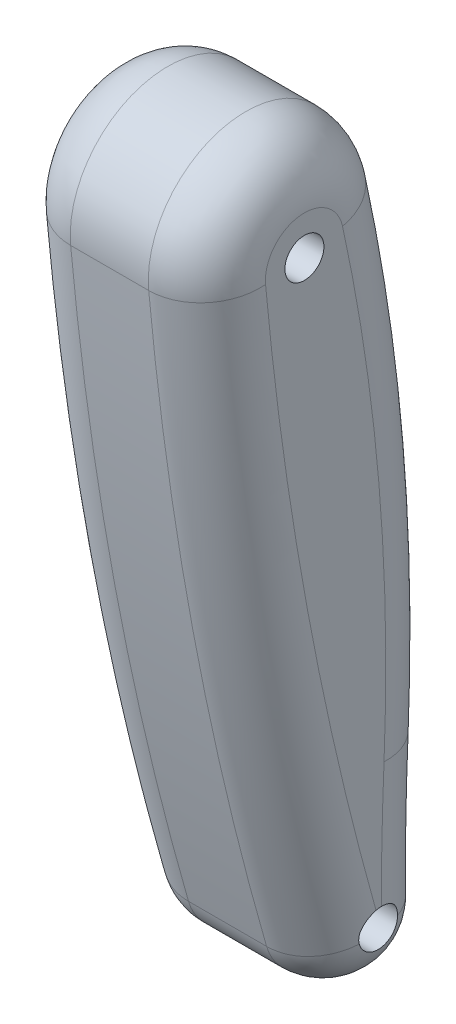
ISO-10303-21;
HEADER;
FILE_DESCRIPTION(('STEP AP214'),'2;1');
FILE_NAME('part.step','',(''),(''),'','','');
FILE_SCHEMA(('AUTOMOTIVE_DESIGN { 1 0 10303 214 1 1 1 1 }'));
ENDSEC;
DATA;
#1=APPLICATION_CONTEXT('core data for automotive mechanical design processes');
#2=APPLICATION_PROTOCOL_DEFINITION('international standard','automotive_design',2000,#1);
#3=PRODUCT_CONTEXT('',#1,'mechanical');
#4=PRODUCT('Part','Part','',(#3));
#5=PRODUCT_RELATED_PRODUCT_CATEGORY('part','',(#4));
#6=PRODUCT_DEFINITION_FORMATION('','',#4);
#7=PRODUCT_DEFINITION_CONTEXT('part definition',#1,'design');
#8=PRODUCT_DEFINITION('design','',#6,#7);
#9=PRODUCT_DEFINITION_SHAPE('','',#8);
#10=(LENGTH_UNIT() NAMED_UNIT(*) SI_UNIT(.MILLI.,.METRE.));
#11=(NAMED_UNIT(*) PLANE_ANGLE_UNIT() SI_UNIT($,.RADIAN.));
#12=(NAMED_UNIT(*) SI_UNIT($,.STERADIAN.) SOLID_ANGLE_UNIT());
#13=UNCERTAINTY_MEASURE_WITH_UNIT(LENGTH_MEASURE(1.E-05),#10,'distance_accuracy_value','');
#14=(GEOMETRIC_REPRESENTATION_CONTEXT(3) GLOBAL_UNCERTAINTY_ASSIGNED_CONTEXT((#13)) GLOBAL_UNIT_ASSIGNED_CONTEXT((#10,
#11,#12)) REPRESENTATION_CONTEXT('',''));
#15=CARTESIAN_POINT('',(0.,0.,0.));
#16=DIRECTION('',(0.,0.,1.));
#17=DIRECTION('',(1.,0.,0.));
#18=AXIS2_PLACEMENT_3D('',#15,#16,#17);
#19=CARTESIAN_POINT('',(63.5,-559.10903574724,-2113.11328138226));
#20=DIRECTION('',(-1.,0.,0.));
#21=DIRECTION('',(0.,0.,1.));
#22=AXIS2_PLACEMENT_3D('',#19,#20,#21);
#23=CYLINDRICAL_SURFACE('',#22,2209.8);
#24=DIRECTION('',(-1.,0.,0.));
#25=VECTOR('',#24,1.);
#26=CARTESIAN_POINT('',(63.5,-761.528986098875,87.3962513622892));
#27=LINE('',#26,#25);
#28=CARTESIAN_POINT('',(25.4,-761.528986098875,87.3962513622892));
#29=VERTEX_POINT('',#28);
#30=CARTESIAN_POINT('',(-25.4,-761.528986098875,87.3962513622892));
#31=VERTEX_POINT('',#30);
#32=EDGE_CURVE('E298',#29,#31,#27,.T.);
#33=ORIENTED_EDGE('',*,*,#32,.T.);
#34=CARTESIAN_POINT('',(-25.4,-559.10903574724,-2113.11328138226));
#35=DIRECTION('',(-1.,0.,0.));
#36=DIRECTION('',(0.,0.,1.));
#37=AXIS2_PLACEMENT_3D('',#34,#35,#36);
#38=CIRCLE('',#37,2209.8);
#39=CARTESIAN_POINT('',(-25.4,-1169.53967872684,10.7017929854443));
#40=VERTEX_POINT('',#39);
#41=EDGE_CURVE('E149',#31,#40,#38,.F.);
#42=ORIENTED_EDGE('',*,*,#41,.T.);
#43=DIRECTION('',(-1.,0.,0.));
#44=VECTOR('',#43,1.);
#45=CARTESIAN_POINT('',(63.5,-1169.53967872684,10.7017929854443));
#46=LINE('',#45,#44);
#47=CARTESIAN_POINT('',(25.4,-1169.53967872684,10.7017929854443));
#48=VERTEX_POINT('',#47);
#49=EDGE_CURVE('E251',#48,#40,#46,.T.);
#50=ORIENTED_EDGE('',*,*,#49,.F.);
#51=CARTESIAN_POINT('',(25.4,-559.10903574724,-2113.11328138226));
#52=DIRECTION('',(-1.,0.,0.));
#53=DIRECTION('',(0.,0.,1.));
#54=AXIS2_PLACEMENT_3D('',#51,#52,#53);
#55=CIRCLE('',#54,2209.8);
#56=EDGE_CURVE('E295',#48,#29,#55,.T.);
#57=ORIENTED_EDGE('',*,*,#56,.T.);
#58=EDGE_LOOP('',(#33,#42,#50,#57));
#59=FACE_BOUND('',#58,.T.);
#60=ADVANCED_FACE('F31',(#59),#23,.T.);
#61=CARTESIAN_POINT('',(63.5,-1159.01501246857,-25.9157082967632));
#62=DIRECTION('',(-1.,0.,0.));
#63=DIRECTION('',(0.,0.,1.));
#64=AXIS2_PLACEMENT_3D('',#61,#62,#63);
#65=CYLINDRICAL_SURFACE('',#64,38.100000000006);
#66=ORIENTED_EDGE('',*,*,#49,.T.);
#67=CARTESIAN_POINT('',(-25.4,-1159.01501246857,-25.9157082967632));
#68=DIRECTION('',(-1.,0.,0.));
#69=DIRECTION('',(0.,0.,1.));
#70=AXIS2_PLACEMENT_3D('',#67,#68,#69);
#71=CIRCLE('',#70,38.100000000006);
#72=CARTESIAN_POINT('',(-25.4,-1158.77775860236,-64.01496958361));
#73=VERTEX_POINT('',#72);
#74=EDGE_CURVE('E255',#40,#73,#71,.F.);
#75=ORIENTED_EDGE('',*,*,#74,.T.);
#76=DIRECTION('',(-1.,0.,0.));
#77=VECTOR('',#76,1.);
#78=CARTESIAN_POINT('',(63.5,-1158.77775860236,-64.01496958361));
#79=LINE('',#78,#77);
#80=CARTESIAN_POINT('',(25.4,-1158.77775860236,-64.01496958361));
#81=VERTEX_POINT('',#80);
#82=EDGE_CURVE('E258',#81,#73,#79,.T.);
#83=ORIENTED_EDGE('',*,*,#82,.F.);
#84=CARTESIAN_POINT('',(25.4,-1159.01501246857,-25.9157082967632));
#85=DIRECTION('',(-1.,0.,0.));
#86=DIRECTION('',(0.,0.,1.));
#87=AXIS2_PLACEMENT_3D('',#84,#85,#86);
#88=CIRCLE('',#87,38.100000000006);
#89=EDGE_CURVE('E257',#81,#48,#88,.T.);
#90=ORIENTED_EDGE('',*,*,#89,.T.);
#91=EDGE_LOOP('',(#66,#75,#83,#90));
#92=FACE_BOUND('',#91,.T.);
#93=ADVANCED_FACE('F240',(#92),#65,.T.);
#94=CARTESIAN_POINT('',(63.5,-1147.29470222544,-1908.01427826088));
#95=DIRECTION('',(-1.,0.,0.));
#96=DIRECTION('',(0.,0.,1.));
#97=AXIS2_PLACEMENT_3D('',#94,#95,#96);
#98=CYLINDRICAL_SURFACE('',#97,1844.03506229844);
#99=ORIENTED_EDGE('',*,*,#82,.T.);
#100=CARTESIAN_POINT('',(-25.4,-1147.29470222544,-1908.01427826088));
#101=DIRECTION('',(-1.,0.,0.));
#102=DIRECTION('',(0.,0.,1.));
#103=AXIS2_PLACEMENT_3D('',#100,#101,#102);
#104=CIRCLE('',#103,1844.03506229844);
#105=CARTESIAN_POINT('',(-25.4,-1067.28642691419,-65.7157175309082));
#106=VERTEX_POINT('',#105);
#107=EDGE_CURVE('E274',#73,#106,#104,.T.);
#108=ORIENTED_EDGE('',*,*,#107,.T.);
#109=DIRECTION('',(-1.,0.,0.));
#110=VECTOR('',#109,1.);
#111=CARTESIAN_POINT('',(63.5,-1067.28642691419,-65.7157175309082));
#112=LINE('',#111,#110);
#113=CARTESIAN_POINT('',(25.4,-1067.28642691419,-65.7157175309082));
#114=VERTEX_POINT('',#113);
#115=EDGE_CURVE('E315',#114,#106,#112,.T.);
#116=ORIENTED_EDGE('',*,*,#115,.F.);
#117=CARTESIAN_POINT('',(25.4,-1147.29470222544,-1908.01427826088));
#118=DIRECTION('',(-1.,0.,0.));
#119=DIRECTION('',(0.,0.,1.));
#120=AXIS2_PLACEMENT_3D('',#117,#118,#119);
#121=CIRCLE('',#120,1844.03506229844);
#122=EDGE_CURVE('E272',#114,#81,#121,.F.);
#123=ORIENTED_EDGE('',*,*,#122,.T.);
#124=EDGE_LOOP('',(#99,#108,#116,#123));
#125=FACE_BOUND('',#124,.T.);
#126=ADVANCED_FACE('F237',(#125),#98,.F.);
#127=CARTESIAN_POINT('',(63.5,-1012.18416138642,1203.08834154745));
#128=DIRECTION('',(-1.,0.,0.));
#129=DIRECTION('',(0.,0.,1.));
#130=AXIS2_PLACEMENT_3D('',#127,#128,#129);
#131=CYLINDRICAL_SURFACE('',#130,1270.);
#132=ORIENTED_EDGE('',*,*,#115,.T.);
#133=CARTESIAN_POINT('',(-25.4,-1012.18416138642,1203.08834154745));
#134=DIRECTION('',(-1.,0.,0.));
#135=DIRECTION('',(0.,0.,1.));
#136=AXIS2_PLACEMENT_3D('',#133,#134,#135);
#137=CIRCLE('',#136,1270.);
#138=CARTESIAN_POINT('',(-25.4,-742.213802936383,-37.8854718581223));
#139=VERTEX_POINT('',#138);
#140=EDGE_CURVE('E290',#106,#139,#137,.F.);
#141=ORIENTED_EDGE('',*,*,#140,.T.);
#142=DIRECTION('',(-1.,0.,0.));
#143=VECTOR('',#142,1.);
#144=CARTESIAN_POINT('',(63.5,-742.213802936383,-37.8854718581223));
#145=LINE('',#144,#143);
#146=CARTESIAN_POINT('',(25.4,-742.213802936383,-37.8854718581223));
#147=VERTEX_POINT('',#146);
#148=EDGE_CURVE('E300',#147,#139,#145,.T.);
#149=ORIENTED_EDGE('',*,*,#148,.F.);
#150=CARTESIAN_POINT('',(25.4,-1012.18416138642,1203.08834154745));
#151=DIRECTION('',(-1.,0.,0.));
#152=DIRECTION('',(0.,0.,1.));
#153=AXIS2_PLACEMENT_3D('',#150,#151,#152);
#154=CIRCLE('',#153,1270.);
#155=EDGE_CURVE('E288',#147,#114,#154,.T.);
#156=ORIENTED_EDGE('',*,*,#155,.T.);
#157=EDGE_LOOP('',(#132,#141,#149,#156));
#158=FACE_BOUND('',#157,.T.);
#159=ADVANCED_FACE('F233',(#158),#131,.T.);
#160=CARTESIAN_POINT('',(63.5,-755.712320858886,24.1632188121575));
#161=DIRECTION('',(-1.,0.,0.));
#162=DIRECTION('',(0.,0.,1.));
#163=AXIS2_PLACEMENT_3D('',#160,#161,#162);
#164=CYLINDRICAL_SURFACE('',#163,63.5000000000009);
#165=ORIENTED_EDGE('',*,*,#148,.T.);
#166=CARTESIAN_POINT('',(-25.4,-755.712320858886,24.1632188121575));
#167=DIRECTION('',(-1.,0.,0.));
#168=DIRECTION('',(0.,0.,1.));
#169=AXIS2_PLACEMENT_3D('',#166,#167,#168);
#170=CIRCLE('',#169,63.5000000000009);
#171=EDGE_CURVE('E293',#139,#31,#170,.F.);
#172=ORIENTED_EDGE('',*,*,#171,.T.);
#173=ORIENTED_EDGE('',*,*,#32,.F.);
#174=CARTESIAN_POINT('',(25.4,-755.712320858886,24.1632188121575));
#175=DIRECTION('',(-1.,0.,0.));
#176=DIRECTION('',(0.,0.,1.));
#177=AXIS2_PLACEMENT_3D('',#174,#175,#176);
#178=CIRCLE('',#177,63.5000000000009);
#179=EDGE_CURVE('E162',#29,#147,#178,.T.);
#180=ORIENTED_EDGE('',*,*,#179,.T.);
#181=EDGE_LOOP('',(#165,#172,#173,#180));
#182=FACE_BOUND('',#181,.T.);
#183=ADVANCED_FACE('F229',(#182),#164,.T.);
#184=CARTESIAN_POINT('',(63.5,-657.410678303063,-1044.47503128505));
#185=DIRECTION('',(-1.,0.,0.));
#186=DIRECTION('',(0.,0.,1.));
#187=AXIS2_PLACEMENT_3D('',#184,#185,#186);
#188=PLANE('',#187);
#189=CARTESIAN_POINT('',(63.5,-755.712320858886,24.1632188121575));
#190=DIRECTION('',(-1.,0.,0.));
#191=DIRECTION('',(0.,0.,1.));
#192=AXIS2_PLACEMENT_3D('',#189,#190,#191);
#193=CIRCLE('',#192,12.7);
#194=CARTESIAN_POINT('',(63.5,-755.712320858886,36.8632188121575));
#195=VERTEX_POINT('',#194);
#196=EDGE_CURVE('E165',#195,#195,#193,.T.);
#197=ORIENTED_EDGE('',*,*,#196,.T.);
#198=EDGE_LOOP('',(#197));
#199=FACE_BOUND('',#198,.T.);
#200=CARTESIAN_POINT('',(63.5,-559.10903574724,-2113.11328138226));
#201=DIRECTION('',(-1.,0.,0.));
#202=DIRECTION('',(0.,0.,1.));
#203=AXIS2_PLACEMENT_3D('',#200,#201,#202);
#204=CIRCLE('',#203,2171.7);
#205=CARTESIAN_POINT('',(63.5,-758.038986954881,49.4564318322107));
#206=VERTEX_POINT('',#205);
#207=CARTESIAN_POINT('',(63.5,-1146.79897292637,-22.4431907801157));
#208=VERTEX_POINT('',#207);
#209=EDGE_CURVE('E138',#206,#208,#204,.F.);
#210=ORIENTED_EDGE('',*,*,#209,.T.);
#211=CARTESIAN_POINT('',(63.5,-1159.01501246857,-25.9157082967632));
#212=DIRECTION('',(-1.,0.,0.));
#213=DIRECTION('',(0.,0.,1.));
#214=AXIS2_PLACEMENT_3D('',#211,#212,#213);
#215=CIRCLE('',#214,12.7);
#216=CARTESIAN_POINT('',(63.5,-1146.31506416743,-25.879470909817));
#217=VERTEX_POINT('',#216);
#218=EDGE_CURVE('E57',#208,#217,#215,.T.);
#219=ORIENTED_EDGE('',*,*,#218,.T.);
#220=CARTESIAN_POINT('',(63.5,-1147.29470222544,-1908.01427826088));
#221=DIRECTION('',(-1.,0.,0.));
#222=DIRECTION('',(0.,0.,1.));
#223=AXIS2_PLACEMENT_3D('',#220,#221,#222);
#224=CIRCLE('',#223,1882.13506229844);
#225=CARTESIAN_POINT('',(63.5,-1065.63335894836,-27.6515957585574));
#226=VERTEX_POINT('',#225);
#227=EDGE_CURVE('E134',#217,#226,#224,.T.);
#228=ORIENTED_EDGE('',*,*,#227,.T.);
#229=CARTESIAN_POINT('',(63.5,-1012.18416138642,1203.08834154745));
#230=DIRECTION('',(-1.,0.,0.));
#231=DIRECTION('',(0.,0.,1.));
#232=AXIS2_PLACEMENT_3D('',#229,#230,#231);
#233=CIRCLE('',#232,1231.9);
#234=CARTESIAN_POINT('',(63.5,-750.312913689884,-0.656257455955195));
#235=VERTEX_POINT('',#234);
#236=EDGE_CURVE('E146',#226,#235,#233,.F.);
#237=ORIENTED_EDGE('',*,*,#236,.T.);
#238=CARTESIAN_POINT('',(63.5,-755.712320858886,24.1632188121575));
#239=DIRECTION('',(-1.,0.,0.));
#240=DIRECTION('',(0.,0.,1.));
#241=AXIS2_PLACEMENT_3D('',#238,#239,#240);
#242=CIRCLE('',#241,25.4000000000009);
#243=EDGE_CURVE('E43',#235,#206,#242,.F.);
#244=ORIENTED_EDGE('',*,*,#243,.T.);
#245=EDGE_LOOP('',(#210,#219,#228,#237,#244));
#246=FACE_BOUND('',#245,.T.);
#247=ADVANCED_FACE('F133',(#199,#246),#188,.F.);
#248=CARTESIAN_POINT('',(-63.5,-657.410678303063,-1044.47503128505));
#249=DIRECTION('',(-1.,0.,0.));
#250=DIRECTION('',(0.,0.,1.));
#251=AXIS2_PLACEMENT_3D('',#248,#249,#250);
#252=PLANE('',#251);
#253=CARTESIAN_POINT('',(-63.5,-1159.01501246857,-25.9157082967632));
#254=DIRECTION('',(-1.,0.,0.));
#255=DIRECTION('',(0.,0.,1.));
#256=AXIS2_PLACEMENT_3D('',#253,#254,#255);
#257=CIRCLE('',#256,12.7);
#258=CARTESIAN_POINT('',(-63.5,-1146.79897292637,-22.4431907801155));
#259=VERTEX_POINT('',#258);
#260=CARTESIAN_POINT('',(-63.5,-1146.31506416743,-25.879470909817));
#261=VERTEX_POINT('',#260);
#262=EDGE_CURVE('E139',#259,#261,#257,.T.);
#263=ORIENTED_EDGE('',*,*,#262,.F.);
#264=CARTESIAN_POINT('',(-63.5,-559.10903574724,-2113.11328138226));
#265=DIRECTION('',(-1.,0.,0.));
#266=DIRECTION('',(0.,0.,1.));
#267=AXIS2_PLACEMENT_3D('',#264,#265,#266);
#268=CIRCLE('',#267,2171.7);
#269=CARTESIAN_POINT('',(-63.5,-758.038986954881,49.4564318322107));
#270=VERTEX_POINT('',#269);
#271=EDGE_CURVE('E279',#259,#270,#268,.T.);
#272=ORIENTED_EDGE('',*,*,#271,.T.);
#273=CARTESIAN_POINT('',(-63.5,-755.712320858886,24.1632188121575));
#274=DIRECTION('',(-1.,0.,0.));
#275=DIRECTION('',(0.,0.,1.));
#276=AXIS2_PLACEMENT_3D('',#273,#274,#275);
#277=CIRCLE('',#276,25.4000000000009);
#278=CARTESIAN_POINT('',(-63.5,-750.312913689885,-0.656257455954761));
#279=VERTEX_POINT('',#278);
#280=EDGE_CURVE('E281',#270,#279,#277,.T.);
#281=ORIENTED_EDGE('',*,*,#280,.T.);
#282=CARTESIAN_POINT('',(-63.5,-1012.18416138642,1203.08834154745));
#283=DIRECTION('',(-1.,0.,0.));
#284=DIRECTION('',(0.,0.,1.));
#285=AXIS2_PLACEMENT_3D('',#282,#283,#284);
#286=CIRCLE('',#285,1231.9);
#287=CARTESIAN_POINT('',(-63.5,-1065.63335894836,-27.6515957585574));
#288=VERTEX_POINT('',#287);
#289=EDGE_CURVE('E283',#279,#288,#286,.T.);
#290=ORIENTED_EDGE('',*,*,#289,.T.);
#291=CARTESIAN_POINT('',(-63.5,-1147.29470222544,-1908.01427826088));
#292=DIRECTION('',(-1.,0.,0.));
#293=DIRECTION('',(0.,0.,1.));
#294=AXIS2_PLACEMENT_3D('',#291,#292,#293);
#295=CIRCLE('',#294,1882.13506229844);
#296=EDGE_CURVE('E285',#288,#261,#295,.F.);
#297=ORIENTED_EDGE('',*,*,#296,.T.);
#298=EDGE_LOOP('',(#263,#272,#281,#290,#297));
#299=FACE_BOUND('',#298,.T.);
#300=CARTESIAN_POINT('',(-63.5,-755.712320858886,24.1632188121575));
#301=DIRECTION('',(-1.,0.,0.));
#302=DIRECTION('',(0.,0.,1.));
#303=AXIS2_PLACEMENT_3D('',#300,#301,#302);
#304=CIRCLE('',#303,12.7);
#305=CARTESIAN_POINT('',(-63.5,-755.712320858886,36.8632188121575));
#306=VERTEX_POINT('',#305);
#307=EDGE_CURVE('E326',#306,#306,#304,.T.);
#308=ORIENTED_EDGE('',*,*,#307,.F.);
#309=EDGE_LOOP('',(#308));
#310=FACE_BOUND('',#309,.T.);
#311=ADVANCED_FACE('F222',(#299,#310),#252,.T.);
#312=CARTESIAN_POINT('',(-25.4,-755.712320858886,24.1632188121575));
#313=DIRECTION('',(-1.,0.,0.));
#314=DIRECTION('',(0.,0.,1.));
#315=AXIS2_PLACEMENT_3D('',#312,#313,#314);
#316=DEGENERATE_TOROIDAL_SURFACE('',#315,25.4000000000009,38.1,.T.);
#317=CARTESIAN_POINT('',(-25.4,-758.038986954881,49.4564318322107));
#318=DIRECTION('',(0.,-0.995795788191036,-0.0916010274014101));
#319=DIRECTION('',(0.,0.0916010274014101,-0.995795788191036));
#320=AXIS2_PLACEMENT_3D('',#317,#318,#319);
#321=CIRCLE('',#320,38.1);
#322=EDGE_CURVE('E305',#31,#270,#321,.T.);
#323=ORIENTED_EDGE('',*,*,#322,.F.);
#324=ORIENTED_EDGE('',*,*,#171,.F.);
#325=CARTESIAN_POINT('',(-25.4,-750.312913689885,-0.656257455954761));
#326=DIRECTION('',(0.,-0.977144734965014,-0.21257508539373));
#327=DIRECTION('',(0.,0.21257508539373,-0.977144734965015));
#328=AXIS2_PLACEMENT_3D('',#325,#326,#327);
#329=CIRCLE('',#328,38.1);
#330=EDGE_CURVE('E301',#279,#139,#329,.T.);
#331=ORIENTED_EDGE('',*,*,#330,.F.);
#332=ORIENTED_EDGE('',*,*,#280,.F.);
#333=EDGE_LOOP('',(#323,#324,#331,#332));
#334=FACE_BOUND('',#333,.T.);
#335=ADVANCED_FACE('F218',(#334),#316,.T.);
#336=CARTESIAN_POINT('',(-25.4,-1012.18416138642,1203.08834154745));
#337=DIRECTION('',(-1.,0.,0.));
#338=DIRECTION('',(0.,0.,1.));
#339=AXIS2_PLACEMENT_3D('',#336,#337,#338);
#340=TOROIDAL_SURFACE('',#339,1231.9,38.1);
#341=ORIENTED_EDGE('',*,*,#330,.T.);
#342=ORIENTED_EDGE('',*,*,#140,.F.);
#343=CARTESIAN_POINT('',(-25.4,-1065.63335894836,-27.6515957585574));
#344=DIRECTION('',(0.,-0.999058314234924,0.0433876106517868));
#345=DIRECTION('',(0.,-0.0433876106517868,-0.999058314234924));
#346=AXIS2_PLACEMENT_3D('',#343,#344,#345);
#347=CIRCLE('',#346,38.1);
#348=EDGE_CURVE('E267',#288,#106,#347,.T.);
#349=ORIENTED_EDGE('',*,*,#348,.F.);
#350=ORIENTED_EDGE('',*,*,#289,.F.);
#351=EDGE_LOOP('',(#341,#342,#349,#350));
#352=FACE_BOUND('',#351,.T.);
#353=ADVANCED_FACE('F214',(#352),#340,.T.);
#354=CARTESIAN_POINT('',(-25.4,-559.10903574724,-2113.11328138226));
#355=DIRECTION('',(-1.,0.,0.));
#356=DIRECTION('',(0.,0.,1.));
#357=AXIS2_PLACEMENT_3D('',#354,#355,#356);
#358=TOROIDAL_SURFACE('',#357,2171.7,38.1);
#359=CARTESIAN_POINT('',(-62.2303895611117,-1169.53987872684,-18.8081636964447));
#360=CARTESIAN_POINT('',(-62.1711927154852,-1169.34415531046,-18.5182953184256));
#361=CARTESIAN_POINT('',(-62.1127392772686,-1169.13634036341,-18.2364194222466));
#362=CARTESIAN_POINT('',(-61.9988625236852,-1168.69778722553,-17.6903589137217));
#363=CARTESIAN_POINT('',(-61.9434398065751,-1168.46704453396,-17.4261777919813));
#364=CARTESIAN_POINT('',(-61.837113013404,-1167.98361319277,-16.9169487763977));
#365=CARTESIAN_POINT('',(-61.7862158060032,-1167.73089229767,-16.6719300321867));
#366=CARTESIAN_POINT('',(-61.6905127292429,-1167.20534247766,-16.2032192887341));
#367=CARTESIAN_POINT('',(-61.6457064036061,-1166.93251506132,-15.9795256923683));
#368=CARTESIAN_POINT('',(-61.5634537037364,-1166.36790717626,-15.554724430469));
#369=CARTESIAN_POINT('',(-61.5260218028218,-1166.07609090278,-15.3536615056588));
#370=CARTESIAN_POINT('',(-61.4598067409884,-1165.47596466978,-14.9762507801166));
#371=CARTESIAN_POINT('',(-61.4310232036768,-1165.16765542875,-14.7999019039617));
#372=CARTESIAN_POINT('',(-61.3830675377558,-1164.53710720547,-14.4735781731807));
#373=CARTESIAN_POINT('',(-61.3638844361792,-1164.21488458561,-14.3235733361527));
#374=CARTESIAN_POINT('',(-61.3357211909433,-1163.55861987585,-14.0509763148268));
#375=CARTESIAN_POINT('',(-61.3267406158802,-1163.22457828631,-13.9283829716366));
#376=CARTESIAN_POINT('',(-61.3194217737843,-1162.55980331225,-13.7156376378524));
#377=CARTESIAN_POINT('',(-61.3207025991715,-1162.2294036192,-13.6244544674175));
#378=CARTESIAN_POINT('',(-61.3329646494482,-1161.56249313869,-13.4691199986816));
#379=CARTESIAN_POINT('',(-61.3439456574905,-1161.22598248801,-13.4049680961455));
#380=CARTESIAN_POINT('',(-61.3752693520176,-1160.54919393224,-13.30407121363));
#381=CARTESIAN_POINT('',(-61.3956153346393,-1160.20891474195,-13.2673358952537));
#382=CARTESIAN_POINT('',(-61.445043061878,-1159.52713904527,-13.2214394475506));
#383=CARTESIAN_POINT('',(-61.4741248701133,-1159.18564253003,-13.2122785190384));
#384=CARTESIAN_POINT('',(-61.5398381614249,-1158.5070229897,-13.2213783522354));
#385=CARTESIAN_POINT('',(-61.5763955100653,-1158.16988918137,-13.2393801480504));
#386=CARTESIAN_POINT('',(-61.6561828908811,-1157.49891659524,-13.3020256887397));
#387=CARTESIAN_POINT('',(-61.6994128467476,-1157.16507777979,-13.3466691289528));
#388=CARTESIAN_POINT('',(-61.7913543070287,-1156.50277017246,-13.462129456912));
#389=CARTESIAN_POINT('',(-61.8400652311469,-1156.17430081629,-13.5329435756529));
#390=CARTESIAN_POINT('',(-61.9417014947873,-1155.52449952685,-13.7001886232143));
#391=CARTESIAN_POINT('',(-61.9946283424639,-1155.20317020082,-13.7966287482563));
#392=CARTESIAN_POINT('',(-62.1058997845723,-1154.55458801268,-14.0195873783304));
#393=CARTESIAN_POINT('',(-62.164382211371,-1154.22777302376,-14.147312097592));
#394=CARTESIAN_POINT('',(-62.2828787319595,-1153.58605057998,-14.4292290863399));
#395=CARTESIAN_POINT('',(-62.3428928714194,-1153.27114348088,-14.5834221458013));
#396=CARTESIAN_POINT('',(-62.4628839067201,-1152.65498963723,-14.9173920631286));
#397=CARTESIAN_POINT('',(-62.5228607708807,-1152.35374951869,-15.0971811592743));
#398=CARTESIAN_POINT('',(-62.6411512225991,-1151.76704700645,-15.4811564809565));
#399=CARTESIAN_POINT('',(-62.6994653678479,-1151.48157929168,-15.6853344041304));
#400=CARTESIAN_POINT('',(-62.814776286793,-1150.91910523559,-16.1239981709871));
#401=CARTESIAN_POINT('',(-62.871668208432,-1150.64267775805,-16.3592548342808));
#402=CARTESIAN_POINT('',(-62.9804794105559,-1150.11044789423,-16.8531190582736));
#403=CARTESIAN_POINT('',(-63.0323985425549,-1149.85464612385,-17.1117273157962));
#404=CARTESIAN_POINT('',(-63.129774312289,-1149.36568911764,-17.6505483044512));
#405=CARTESIAN_POINT('',(-63.1752326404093,-1149.13252796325,-17.9307553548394));
#406=CARTESIAN_POINT('',(-63.2583847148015,-1148.69067429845,-18.5109140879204));
#407=CARTESIAN_POINT('',(-63.2960788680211,-1148.48198050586,-18.8108647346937));
#408=CARTESIAN_POINT('',(-63.3616419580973,-1148.09641242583,-19.4195374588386));
#409=CARTESIAN_POINT('',(-63.3897604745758,-1147.91880033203,-19.7277653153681));
#410=CARTESIAN_POINT('',(-63.4368210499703,-1147.58980861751,-20.3586173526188));
#411=CARTESIAN_POINT('',(-63.455762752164,-1147.43843001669,-20.6812420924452));
#412=CARTESIAN_POINT('',(-63.4839118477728,-1147.1632516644,-21.3383075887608));
#413=CARTESIAN_POINT('',(-63.4931229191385,-1147.03944150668,-21.6727438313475));
#414=CARTESIAN_POINT('',(-63.501545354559,-1146.82037730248,-22.3509115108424));
#415=CARTESIAN_POINT('',(-63.5007591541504,-1146.72511630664,-22.6946406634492));
#416=CARTESIAN_POINT('',(-63.4910666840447,-1146.58969518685,-23.2774934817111));
#417=CARTESIAN_POINT('',(-63.4848412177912,-1146.54165878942,-23.5148679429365));
#418=CARTESIAN_POINT('',(-63.4678713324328,-1146.4592497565,-23.9918136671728));
#419=CARTESIAN_POINT('',(-63.4571272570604,-1146.42487608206,-24.2313847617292));
#420=CARTESIAN_POINT('',(-63.431273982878,-1146.36992237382,-24.7115470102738));
#421=CARTESIAN_POINT('',(-63.4161704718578,-1146.34932448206,-24.9521364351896));
#422=CARTESIAN_POINT('',(-63.3817984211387,-1146.32186137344,-25.4338458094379));
#423=CARTESIAN_POINT('',(-63.3625291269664,-1146.31499864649,-25.6749658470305));
#424=CARTESIAN_POINT('',(-63.3412824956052,-1146.31501247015,-25.9159082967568));
#425=B_SPLINE_CURVE_WITH_KNOTS('',3,(#359,#360,#361,#362,#363,#364,#365,#366,#367,#368,#369,
#370,#371,#372,#373,#374,#375,#376,#377,#378,#379,#380,#381,#382,#383,#384,#385,#386,#387,#388,
#389,#390,#391,#392,#393,#394,#395,#396,#397,#398,#399,#400,#401,#402,#403,#404,#405,#406,#407,
#408,#409,#410,#411,#412,#413,#414,#415,#416,#417,#418,#419,#420,#421,#422,#423,#424),
.UNSPECIFIED.,.F.,.F.,(4,2,2,2,2,2,2,2,2,2,2,2,2,2,2,2,2,2,2,2,2,2,2,2,2,2,2,2,2,2,2,2,4),(0.,
1.06393113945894,2.12807154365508,3.19380043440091,4.2594494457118,5.32716954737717,
6.394843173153,7.46129368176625,8.52769909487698,9.55470772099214,10.5816933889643,
11.6090407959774,12.6363956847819,13.6540175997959,14.6716278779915,15.6891305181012,
16.7069987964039,17.7729768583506,18.8389867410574,19.9055080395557,20.9716673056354,
22.0725691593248,23.1735038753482,24.2741500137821,25.3747384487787,26.4439345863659,
27.5131722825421,28.5820056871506,29.6505787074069,30.3769761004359,31.1033182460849,
31.828716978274,32.5542471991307),.UNSPECIFIED.);
#426=CARTESIAN_POINT('',(-61.3210244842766,-1162.52323455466,-13.7098745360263));
#427=VERTEX_POINT('',#426);
#428=EDGE_CURVE('E199',#427,#259,#425,.T.);
#429=ORIENTED_EDGE('',*,*,#428,.F.);
#430=CARTESIAN_POINT('',(-25.4,-1159.01501246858,-25.9157082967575));
#431=DIRECTION('',(0.,-0.961089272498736,-0.276237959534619));
#432=DIRECTION('',(0.,0.276237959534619,-0.961089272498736));
#433=AXIS2_PLACEMENT_3D('',#430,#431,#432);
#434=CIRCLE('',#433,38.1);
#435=EDGE_CURVE('E263',#40,#427,#434,.T.);
#436=ORIENTED_EDGE('',*,*,#435,.F.);
#437=ORIENTED_EDGE('',*,*,#41,.F.);
#438=ORIENTED_EDGE('',*,*,#322,.T.);
#439=ORIENTED_EDGE('',*,*,#271,.F.);
#440=EDGE_LOOP('',(#429,#436,#437,#438,#439));
#441=FACE_BOUND('',#440,.T.);
#442=ADVANCED_FACE('F209',(#441),#358,.T.);
#443=CARTESIAN_POINT('',(-25.4,-1147.29470222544,-1908.01427826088));
#444=DIRECTION('',(-1.,0.,0.));
#445=DIRECTION('',(0.,0.,1.));
#446=AXIS2_PLACEMENT_3D('',#443,#444,#445);
#447=TOROIDAL_SURFACE('',#446,1882.13506229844,38.1);
#448=CARTESIAN_POINT('',(-63.4999999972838,-1146.3150654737,-25.8790159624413));
#449=CARTESIAN_POINT('',(-63.5000036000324,-1146.31456380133,-26.0525237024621));
#450=CARTESIAN_POINT('',(-63.4988185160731,-1146.31761930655,-26.2260195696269));
#451=CARTESIAN_POINT('',(-63.4940868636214,-1146.33083134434,-26.5727060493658));
#452=CARTESIAN_POINT('',(-63.4905403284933,-1146.34098777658,-26.7458966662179));
#453=CARTESIAN_POINT('',(-63.4763866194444,-1146.38207614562,-27.2644385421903));
#454=CARTESIAN_POINT('',(-63.4622653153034,-1146.4236267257,-27.6089180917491));
#455=CARTESIAN_POINT('',(-63.4250793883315,-1146.5344932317,-28.2918450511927));
#456=CARTESIAN_POINT('',(-63.4020398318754,-1146.60373135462,-28.6303066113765));
#457=CARTESIAN_POINT('',(-63.3476289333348,-1146.76934096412,-29.2998547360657));
#458=CARTESIAN_POINT('',(-63.3162573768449,-1146.86571314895,-29.6309411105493));
#459=CARTESIAN_POINT('',(-63.2460239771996,-1147.08470290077,-30.283323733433));
#460=CARTESIAN_POINT('',(-63.2071653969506,-1147.20730903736,-30.6046241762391));
#461=CARTESIAN_POINT('',(-63.122953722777,-1147.47779856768,-31.2355303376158));
#462=CARTESIAN_POINT('',(-63.077600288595,-1147.62568328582,-31.5451354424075));
#463=CARTESIAN_POINT('',(-62.981534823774,-1147.94567866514,-32.1508695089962));
#464=CARTESIAN_POINT('',(-62.9308203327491,-1148.11780046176,-32.4469921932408));
#465=CARTESIAN_POINT('',(-62.8253271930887,-1148.48501049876,-33.023870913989));
#466=CARTESIAN_POINT('',(-62.7705484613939,-1148.68009920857,-33.3046266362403));
#467=CARTESIAN_POINT('',(-62.6565601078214,-1149.09833966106,-33.8575881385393));
#468=CARTESIAN_POINT('',(-62.5972658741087,-1149.32217228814,-34.1292616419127));
#469=CARTESIAN_POINT('',(-62.4773672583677,-1149.7915163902,-34.6530317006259));
#470=CARTESIAN_POINT('',(-62.4167624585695,-1150.03703485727,-34.9051218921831));
#471=CARTESIAN_POINT('',(-62.295875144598,-1150.54821090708,-35.3881385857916));
#472=CARTESIAN_POINT('',(-62.235592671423,-1150.81387098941,-35.6190624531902));
#473=CARTESIAN_POINT('',(-62.1169986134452,-1151.36372027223,-36.0582692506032));
#474=CARTESIAN_POINT('',(-62.0586870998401,-1151.64791014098,-36.2665513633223));
#475=CARTESIAN_POINT('',(-61.9439958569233,-1152.24178184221,-36.6648911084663));
#476=CARTESIAN_POINT('',(-61.8877242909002,-1152.55196906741,-36.8542274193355));
#477=CARTESIAN_POINT('',(-61.7807519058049,-1153.18805551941,-37.2059068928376));
#478=CARTESIAN_POINT('',(-61.7300489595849,-1153.5139486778,-37.3682603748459));
#479=CARTESIAN_POINT('',(-61.6358407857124,-1154.17912069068,-37.6646076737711));
#480=CARTESIAN_POINT('',(-61.5923306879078,-1154.51839029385,-37.7986206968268));
#481=CARTESIAN_POINT('',(-61.5139227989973,-1155.20805397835,-38.0371819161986));
#482=CARTESIAN_POINT('',(-61.4790228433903,-1155.55844523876,-38.141737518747));
#483=CARTESIAN_POINT('',(-61.4276516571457,-1156.16572582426,-38.2947032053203));
#484=CARTESIAN_POINT('',(-61.408766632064,-1156.42055048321,-38.3506135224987));
#485=CARTESIAN_POINT('',(-61.3763097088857,-1156.93344982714,-38.4466756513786));
#486=CARTESIAN_POINT('',(-61.3627366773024,-1157.19152380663,-38.4868308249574));
#487=CARTESIAN_POINT('',(-61.341154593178,-1157.7099424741,-38.5511746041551));
#488=CARTESIAN_POINT('',(-61.333146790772,-1157.97028765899,-38.5753596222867));
#489=CARTESIAN_POINT('',(-61.3228249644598,-1158.49215902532,-38.6076387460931));
#490=CARTESIAN_POINT('',(-61.3205125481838,-1158.75368551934,-38.615728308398));
#491=CARTESIAN_POINT('',(-61.3211125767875,-1159.01521246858,-38.6157082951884));
#492=B_SPLINE_CURVE_WITH_KNOTS('',3,(#448,#449,#450,#451,#452,#453,#454,#455,#456,#457,#458,
#459,#460,#461,#462,#463,#464,#465,#466,#467,#468,#469,#470,#471,#472,#473,#474,#475,#476,#477,
#478,#479,#480,#481,#482,#483,#484,#485,#486,#487,#488,#489,#490,#491),.UNSPECIFIED.,.F.,.F.,(4,
2,2,2,2,2,2,2,2,2,2,2,2,2,2,2,2,2,2,2,2,4),(0.,0.520440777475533,1.04087420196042,
2.08126785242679,3.11875827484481,4.1562753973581,5.19334137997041,6.23046171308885,
7.26806010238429,8.3056797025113,9.37536235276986,10.4453911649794,11.5155529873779,
12.5857534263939,13.6876103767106,14.7890449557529,15.8897306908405,16.9901394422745,
17.774339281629,18.5583716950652,19.3425801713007,20.1270099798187),.UNSPECIFIED.);
#493=CARTESIAN_POINT('',(-61.3210244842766,-1158.9359278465,-38.6154620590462));
#494=VERTEX_POINT('',#493);
#495=EDGE_CURVE('E50',#261,#494,#492,.T.);
#496=ORIENTED_EDGE('',*,*,#495,.F.);
#497=ORIENTED_EDGE('',*,*,#296,.F.);
#498=ORIENTED_EDGE('',*,*,#348,.T.);
#499=ORIENTED_EDGE('',*,*,#107,.F.);
#500=CARTESIAN_POINT('',(-25.4,-1159.01501246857,-25.9157082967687));
#501=DIRECTION('',(0.,-0.999980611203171,-0.00622713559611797));
#502=DIRECTION('',(0.,0.00622713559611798,-0.999980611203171));
#503=AXIS2_PLACEMENT_3D('',#500,#501,#502);
#504=CIRCLE('',#503,38.1);
#505=EDGE_CURVE('E268',#494,#73,#504,.T.);
#506=ORIENTED_EDGE('',*,*,#505,.F.);
#507=EDGE_LOOP('',(#496,#497,#498,#499,#506));
#508=FACE_BOUND('',#507,.T.);
#509=ADVANCED_FACE('F205',(#508),#447,.T.);
#510=CARTESIAN_POINT('',(-25.4,-1159.01501246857,-25.9157082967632));
#511=DIRECTION('',(0.,0.,1.));
#512=DIRECTION('',(1.,0.,0.));
#513=AXIS2_PLACEMENT_3D('',#510,#511,#512);
#514=SPHERICAL_SURFACE('',#513,38.1);
#515=CARTESIAN_POINT('',(-61.3210244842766,-1159.01501246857,-25.9157082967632));
#516=DIRECTION('',(1.,0.,0.));
#517=DIRECTION('',(0.,0.,-1.));
#518=AXIS2_PLACEMENT_3D('',#515,#516,#517);
#519=CIRCLE('',#518,12.7);
#520=EDGE_CURVE('E129',#494,#427,#519,.F.);
#521=ORIENTED_EDGE('',*,*,#520,.F.);
#522=ORIENTED_EDGE('',*,*,#505,.T.);
#523=ORIENTED_EDGE('',*,*,#74,.F.);
#524=ORIENTED_EDGE('',*,*,#435,.T.);
#525=EDGE_LOOP('',(#521,#522,#523,#524));
#526=FACE_BOUND('',#525,.T.);
#527=ADVANCED_FACE('F208',(#526),#514,.T.);
#528=CARTESIAN_POINT('',(25.4,-1147.29470222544,-1908.01427826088));
#529=DIRECTION('',(-1.,0.,0.));
#530=DIRECTION('',(0.,0.,1.));
#531=AXIS2_PLACEMENT_3D('',#528,#529,#530);
#532=TOROIDAL_SURFACE('',#531,1882.13506229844,38.1);
#533=CARTESIAN_POINT('',(61.3211125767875,-1159.01521246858,-38.6157082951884));
#534=CARTESIAN_POINT('',(61.3207259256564,-1158.84214459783,-38.6157114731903));
#535=CARTESIAN_POINT('',(61.3216030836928,-1158.66909614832,-38.6121754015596));
#536=CARTESIAN_POINT('',(61.3258663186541,-1158.32332202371,-38.5980388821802));
#537=CARTESIAN_POINT('',(61.3292523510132,-1158.15059634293,-38.5874385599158));
#538=CARTESIAN_POINT('',(61.343141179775,-1157.63349058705,-38.5450761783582));
#539=CARTESIAN_POINT('',(61.3573743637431,-1157.29001013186,-38.5027526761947));
#540=CARTESIAN_POINT('',(61.395273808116,-1156.60925238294,-38.3905234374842));
#541=CARTESIAN_POINT('',(61.4189111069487,-1156.27195933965,-38.3207023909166));
#542=CARTESIAN_POINT('',(61.4748726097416,-1155.60481347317,-38.1541207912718));
#543=CARTESIAN_POINT('',(61.5071971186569,-1155.27496091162,-38.0573592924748));
#544=CARTESIAN_POINT('',(61.5795144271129,-1154.62519671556,-37.8378320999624));
#545=CARTESIAN_POINT('',(61.6195012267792,-1154.30527752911,-37.7150867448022));
#546=CARTESIAN_POINT('',(61.7059962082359,-1153.67701997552,-37.4444925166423));
#547=CARTESIAN_POINT('',(61.7525068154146,-1153.36868596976,-37.2966343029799));
#548=CARTESIAN_POINT('',(61.8507380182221,-1152.76545827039,-36.9768860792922));
#549=CARTESIAN_POINT('',(61.9024606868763,-1152.4705699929,-36.8049864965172));
#550=CARTESIAN_POINT('',(62.0096895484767,-1151.89604589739,-36.438371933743));
#551=CARTESIAN_POINT('',(62.0651959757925,-1151.61641102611,-36.2436555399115));
#552=CARTESIAN_POINT('',(62.1805379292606,-1151.06433956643,-35.8253479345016));
#553=CARTESIAN_POINT('',(62.2404571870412,-1150.79251096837,-35.6009770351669));
#554=CARTESIAN_POINT('',(62.361131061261,-1150.26852895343,-35.1305334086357));
#555=CARTESIAN_POINT('',(62.4218856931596,-1150.01637590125,-34.8844602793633));
#556=CARTESIAN_POINT('',(62.5426056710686,-1149.53323387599,-34.3720604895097));
#557=CARTESIAN_POINT('',(62.6025708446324,-1149.30224946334,-34.1057294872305));
#558=CARTESIAN_POINT('',(62.7200972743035,-1148.86299092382,-33.5544689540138));
#559=CARTESIAN_POINT('',(62.7776586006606,-1148.654716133,-33.2695399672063));
#560=CARTESIAN_POINT('',(62.890396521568,-1148.25681778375,-32.6746167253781));
#561=CARTESIAN_POINT('',(62.9454620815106,-1148.06787506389,-32.3641454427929));
#562=CARTESIAN_POINT('',(63.0498563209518,-1147.71701198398,-31.7275256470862));
#563=CARTESIAN_POINT('',(63.0991872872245,-1147.55508084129,-31.4013834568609));
#564=CARTESIAN_POINT('',(63.1906990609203,-1147.25959477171,-30.7357381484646));
#565=CARTESIAN_POINT('',(63.2328838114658,-1147.12602418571,-30.3962425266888));
#566=CARTESIAN_POINT('',(63.3089007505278,-1146.88838417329,-29.7062175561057));
#567=CARTESIAN_POINT('',(63.3427349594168,-1146.78430761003,-29.3556908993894));
#568=CARTESIAN_POINT('',(63.3928138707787,-1146.63176740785,-28.7466204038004));
#569=CARTESIAN_POINT('',(63.4113270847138,-1146.57589979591,-28.4900893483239));
#570=CARTESIAN_POINT('',(63.4432698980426,-1146.48013259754,-27.9737884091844));
#571=CARTESIAN_POINT('',(63.4567005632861,-1146.44022966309,-27.7140192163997));
#572=CARTESIAN_POINT('',(63.4782687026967,-1146.37660266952,-27.1922825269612));
#573=CARTESIAN_POINT('',(63.4864060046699,-1146.35287913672,-26.9303149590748));
#574=CARTESIAN_POINT('',(63.4972815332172,-1146.32172046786,-26.4052313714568));
#575=CARTESIAN_POINT('',(63.5000183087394,-1146.3142897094,-26.1421150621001));
#576=CARTESIAN_POINT('',(63.4999999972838,-1146.3150654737,-25.8790159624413));
#577=B_SPLINE_CURVE_WITH_KNOTS('',3,(#533,#534,#535,#536,#537,#538,#539,#540,#541,#542,#543,
#544,#545,#546,#547,#548,#549,#550,#551,#552,#553,#554,#555,#556,#557,#558,#559,#560,#561,#562,
#563,#564,#565,#566,#567,#568,#569,#570,#571,#572,#573,#574,#575,#576),.UNSPECIFIED.,.F.,.F.,(4,
2,2,2,2,2,2,2,2,2,2,2,2,2,2,2,2,2,2,2,2,4),(0.,0.519119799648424,1.03823037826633,
2.0759382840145,3.11047482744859,4.14504769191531,5.17881373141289,6.21296512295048,
7.24752946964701,8.28215795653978,9.35351734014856,10.4248965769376,11.4965060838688,
12.5680842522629,13.6695008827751,14.7704767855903,15.8708432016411,16.9709431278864,
17.7600190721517,18.5489294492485,19.3378654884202,20.1270134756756),.UNSPECIFIED.);
#578=CARTESIAN_POINT('',(61.3210244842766,-1158.9359278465,-38.6154620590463));
#579=VERTEX_POINT('',#578);
#580=EDGE_CURVE('E121',#579,#217,#577,.T.);
#581=ORIENTED_EDGE('',*,*,#580,.F.);
#582=CARTESIAN_POINT('',(25.4,-1159.01501246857,-25.9157082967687));
#583=DIRECTION('',(0.,-0.999980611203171,-0.00622713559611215));
#584=DIRECTION('',(0.,0.00622713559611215,-0.999980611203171));
#585=AXIS2_PLACEMENT_3D('',#582,#583,#584);
#586=CIRCLE('',#585,38.1);
#587=EDGE_CURVE('E174',#81,#579,#586,.T.);
#588=ORIENTED_EDGE('',*,*,#587,.F.);
#589=ORIENTED_EDGE('',*,*,#122,.F.);
#590=CARTESIAN_POINT('',(25.4,-1065.63335894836,-27.6515957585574));
#591=DIRECTION('',(0.,0.999058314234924,-0.0433876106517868));
#592=DIRECTION('',(0.,0.0433876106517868,0.999058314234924));
#593=AXIS2_PLACEMENT_3D('',#590,#591,#592);
#594=CIRCLE('',#593,38.1);
#595=EDGE_CURVE('E144',#226,#114,#594,.T.);
#596=ORIENTED_EDGE('',*,*,#595,.F.);
#597=ORIENTED_EDGE('',*,*,#227,.F.);
#598=EDGE_LOOP('',(#581,#588,#589,#596,#597));
#599=FACE_BOUND('',#598,.T.);
#600=ADVANCED_FACE('F141',(#599),#532,.T.);
#601=CARTESIAN_POINT('',(25.4,-1159.01501246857,-25.9157082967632));
#602=DIRECTION('',(0.,0.,1.));
#603=DIRECTION('',(1.,0.,0.));
#604=AXIS2_PLACEMENT_3D('',#601,#602,#603);
#605=SPHERICAL_SURFACE('',#604,38.1);
#606=CARTESIAN_POINT('',(61.3210244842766,-1159.01501246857,-25.9157082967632));
#607=DIRECTION('',(-1.,0.,0.));
#608=DIRECTION('',(0.,0.,1.));
#609=AXIS2_PLACEMENT_3D('',#606,#607,#608);
#610=CIRCLE('',#609,12.7);
#611=CARTESIAN_POINT('',(61.3210244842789,-1162.52323455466,-13.7098745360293));
#612=VERTEX_POINT('',#611);
#613=EDGE_CURVE('E124',#612,#579,#610,.F.);
#614=ORIENTED_EDGE('',*,*,#613,.F.);
#615=CARTESIAN_POINT('',(25.4,-1159.01501246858,-25.9157082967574));
#616=DIRECTION('',(0.,0.961089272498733,0.27623795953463));
#617=DIRECTION('',(0.,-0.27623795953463,0.961089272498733));
#618=AXIS2_PLACEMENT_3D('',#615,#616,#617);
#619=CIRCLE('',#618,38.1);
#620=EDGE_CURVE('E170',#48,#612,#619,.T.);
#621=ORIENTED_EDGE('',*,*,#620,.F.);
#622=ORIENTED_EDGE('',*,*,#89,.F.);
#623=ORIENTED_EDGE('',*,*,#587,.T.);
#624=EDGE_LOOP('',(#614,#621,#622,#623));
#625=FACE_BOUND('',#624,.T.);
#626=ADVANCED_FACE('F172',(#625),#605,.T.);
#627=CARTESIAN_POINT('',(25.4,-1012.18416138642,1203.08834154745));
#628=DIRECTION('',(-1.,0.,0.));
#629=DIRECTION('',(0.,0.,1.));
#630=AXIS2_PLACEMENT_3D('',#627,#628,#629);
#631=TOROIDAL_SURFACE('',#630,1231.9,38.1);
#632=ORIENTED_EDGE('',*,*,#595,.T.);
#633=ORIENTED_EDGE('',*,*,#155,.F.);
#634=CARTESIAN_POINT('',(25.4,-750.312913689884,-0.656257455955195));
#635=DIRECTION('',(0.,0.977144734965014,0.21257508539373));
#636=DIRECTION('',(0.,-0.21257508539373,0.977144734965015));
#637=AXIS2_PLACEMENT_3D('',#634,#635,#636);
#638=CIRCLE('',#637,38.1);
#639=EDGE_CURVE('E157',#235,#147,#638,.T.);
#640=ORIENTED_EDGE('',*,*,#639,.F.);
#641=ORIENTED_EDGE('',*,*,#236,.F.);
#642=EDGE_LOOP('',(#632,#633,#640,#641));
#643=FACE_BOUND('',#642,.T.);
#644=ADVANCED_FACE('F338',(#643),#631,.T.);
#645=CARTESIAN_POINT('',(25.4,-559.10903574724,-2113.11328138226));
#646=DIRECTION('',(-1.,0.,0.));
#647=DIRECTION('',(0.,0.,1.));
#648=AXIS2_PLACEMENT_3D('',#645,#646,#647);
#649=TOROIDAL_SURFACE('',#648,2171.7,38.1);
#650=CARTESIAN_POINT('',(63.3412824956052,-1146.31501247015,-25.9159082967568));
#651=CARTESIAN_POINT('',(63.3712800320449,-1146.31496435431,-25.5760238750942));
#652=CARTESIAN_POINT('',(63.3973040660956,-1146.32864455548,-25.2357723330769));
#653=CARTESIAN_POINT('',(63.4409025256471,-1146.38333140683,-24.5569201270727));
#654=CARTESIAN_POINT('',(63.4584767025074,-1146.42433886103,-24.2183195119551));
#655=CARTESIAN_POINT('',(63.4846506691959,-1146.53346517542,-23.5456975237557));
#656=CARTESIAN_POINT('',(63.4932643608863,-1146.60154181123,-23.211669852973));
#657=CARTESIAN_POINT('',(63.5013553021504,-1146.76435631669,-22.5500804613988));
#658=CARTESIAN_POINT('',(63.5008329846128,-1146.85909292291,-22.2225184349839));
#659=CARTESIAN_POINT('',(63.4906658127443,-1147.07463631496,-21.5759327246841));
#660=CARTESIAN_POINT('',(63.4810134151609,-1147.19546459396,-21.2569163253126));
#661=CARTESIAN_POINT('',(63.4528381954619,-1147.46222325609,-20.6299611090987));
#662=CARTESIAN_POINT('',(63.4343152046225,-1147.60815411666,-20.3220225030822));
#663=CARTESIAN_POINT('',(63.3888940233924,-1147.92396567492,-19.7193871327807));
#664=CARTESIAN_POINT('',(63.3619969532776,-1148.0938431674,-19.4246886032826));
#665=CARTESIAN_POINT('',(63.3005283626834,-1148.45626601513,-18.8504298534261));
#666=CARTESIAN_POINT('',(63.2659568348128,-1148.64881139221,-18.5708696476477));
#667=CARTESIAN_POINT('',(63.1898034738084,-1149.05632346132,-18.0270691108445));
#668=CARTESIAN_POINT('',(63.1481823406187,-1149.27141311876,-17.7629264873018));
#669=CARTESIAN_POINT('',(63.0591250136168,-1149.72155598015,-17.2533033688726));
#670=CARTESIAN_POINT('',(63.0116887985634,-1149.95660925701,-17.0078229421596));
#671=CARTESIAN_POINT('',(62.9121699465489,-1150.44515558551,-16.5368649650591));
#672=CARTESIAN_POINT('',(62.8600862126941,-1150.69865298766,-16.3113921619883));
#673=CARTESIAN_POINT('',(62.7525427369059,-1151.22251529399,-15.8816757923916));
#674=CARTESIAN_POINT('',(62.6970817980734,-1151.49288617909,-15.6774398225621));
#675=CARTESIAN_POINT('',(62.5815705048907,-1152.0614967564,-15.2825602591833));
#676=CARTESIAN_POINT('',(62.5214262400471,-1152.36044536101,-15.0929641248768));
#677=CARTESIAN_POINT('',(62.4005473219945,-1152.97302884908,-14.7394161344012));
#678=CARTESIAN_POINT('',(62.3398126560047,-1153.28666405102,-14.5754648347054));
#679=CARTESIAN_POINT('',(62.2193737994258,-1153.92677997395,-14.2741855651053));
#680=CARTESIAN_POINT('',(62.1596699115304,-1154.25326437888,-14.1368652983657));
#681=CARTESIAN_POINT('',(62.0429755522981,-1154.91686900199,-13.8898811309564));
#682=CARTESIAN_POINT('',(61.9859841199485,-1155.25398538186,-13.7802073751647));
#683=CARTESIAN_POINT('',(61.8750641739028,-1155.94459305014,-13.5871252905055));
#684=CARTESIAN_POINT('',(61.8212340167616,-1156.29828223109,-13.5043667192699));
#685=CARTESIAN_POINT('',(61.719724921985,-1157.01232104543,-13.3693444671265));
#686=CARTESIAN_POINT('',(61.6720461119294,-1157.37267081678,-13.3170814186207));
#687=CARTESIAN_POINT('',(61.5843716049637,-1158.09738799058,-13.2436689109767));
#688=CARTESIAN_POINT('',(61.5443743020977,-1158.46175453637,-13.2225129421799));
#689=CARTESIAN_POINT('',(61.4733804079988,-1159.19183042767,-13.2116933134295));
#690=CARTESIAN_POINT('',(61.4423833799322,-1159.55753970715,-13.2220281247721));
#691=CARTESIAN_POINT('',(61.3914606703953,-1160.27325595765,-13.2732990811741));
#692=CARTESIAN_POINT('',(61.3711523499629,-1160.62332201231,-13.3130332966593));
#693=CARTESIAN_POINT('',(61.3404968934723,-1161.31936719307,-13.421549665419));
#694=CARTESIAN_POINT('',(61.3301495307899,-1161.66534641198,-13.4903311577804));
#695=CARTESIAN_POINT('',(61.3197619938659,-1162.35040532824,-13.6564530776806));
#696=CARTESIAN_POINT('',(61.3197181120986,-1162.68948746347,-13.7537832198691));
#697=CARTESIAN_POINT('',(61.3299300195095,-1163.35823414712,-13.9762529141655));
#698=CARTESIAN_POINT('',(61.3401854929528,-1163.68789898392,-14.1013916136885));
#699=CARTESIAN_POINT('',(61.3700249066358,-1164.32195497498,-14.3727301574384));
#700=CARTESIAN_POINT('',(61.3892073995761,-1164.62682787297,-14.5178507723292));
#701=CARTESIAN_POINT('',(61.4361484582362,-1165.22355092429,-14.8315900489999));
#702=CARTESIAN_POINT('',(61.4639072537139,-1165.51540072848,-15.0002093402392));
#703=CARTESIAN_POINT('',(61.5271984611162,-1166.08428383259,-15.3597299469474));
#704=CARTESIAN_POINT('',(61.5627337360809,-1166.36131162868,-15.5506394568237));
#705=CARTESIAN_POINT('',(61.6405621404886,-1166.89873543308,-15.9532975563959));
#706=CARTESIAN_POINT('',(61.6828545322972,-1167.15913325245,-16.1650438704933));
#707=CARTESIAN_POINT('',(61.764364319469,-1167.61347941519,-16.5653285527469));
#708=CARTESIAN_POINT('',(61.8026103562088,-1167.81057988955,-16.7505051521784));
#709=CARTESIAN_POINT('',(61.8820926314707,-1168.19227148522,-17.1327218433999));
#710=CARTESIAN_POINT('',(61.923328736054,-1168.37686316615,-17.3297614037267));
#711=CARTESIAN_POINT('',(62.0080096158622,-1168.73251654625,-17.7344782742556));
#712=CARTESIAN_POINT('',(62.0514495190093,-1168.9036061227,-17.9421321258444));
#713=CARTESIAN_POINT('',(62.1399111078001,-1169.23212967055,-18.3676740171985));
#714=CARTESIAN_POINT('',(62.1849328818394,-1169.38956287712,-18.5855626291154));
#715=CARTESIAN_POINT('',(62.2303895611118,-1169.53987872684,-18.8081636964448));
#716=B_SPLINE_CURVE_WITH_KNOTS('',3,(#650,#651,#652,#653,#654,#655,#656,#657,#658,#659,#660,
#661,#662,#663,#664,#665,#666,#667,#668,#669,#670,#671,#672,#673,#674,#675,#676,#677,#678,#679,
#680,#681,#682,#683,#684,#685,#686,#687,#688,#689,#690,#691,#692,#693,#694,#695,#696,#697,#698,
#699,#700,#701,#702,#703,#704,#705,#706,#707,#708,#709,#710,#711,#712,#713,#714,#715),
.UNSPECIFIED.,.F.,.F.,(4,2,2,2,2,2,2,2,2,2,2,2,2,2,2,2,2,2,2,2,2,2,2,2,2,2,2,2,2,2,2,2,4),(0.,
1.02334335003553,2.04671681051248,3.06850016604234,4.09023510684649,5.11281494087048,
6.1354142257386,7.15787676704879,8.18034029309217,9.20870367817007,10.2370708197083,
11.2656813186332,12.294658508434,13.3706517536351,14.4466683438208,15.5229957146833,
16.5989388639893,17.699203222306,18.7994903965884,19.8995472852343,20.9995507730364,
22.0569077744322,23.1142407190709,24.1711932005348,25.2281132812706,26.2415187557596,
27.2549513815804,28.2687577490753,29.2824535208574,30.1013126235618,30.9201350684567,
31.7372201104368,32.5543508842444),.UNSPECIFIED.);
#717=EDGE_CURVE('E11',#208,#612,#716,.T.);
#718=ORIENTED_EDGE('',*,*,#717,.F.);
#719=ORIENTED_EDGE('',*,*,#209,.F.);
#720=CARTESIAN_POINT('',(25.4,-758.038986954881,49.4564318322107));
#721=DIRECTION('',(0.,0.995795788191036,0.0916010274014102));
#722=DIRECTION('',(0.,-0.0916010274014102,0.995795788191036));
#723=AXIS2_PLACEMENT_3D('',#720,#721,#722);
#724=CIRCLE('',#723,38.1);
#725=EDGE_CURVE('E160',#29,#206,#724,.T.);
#726=ORIENTED_EDGE('',*,*,#725,.F.);
#727=ORIENTED_EDGE('',*,*,#56,.F.);
#728=ORIENTED_EDGE('',*,*,#620,.T.);
#729=EDGE_LOOP('',(#718,#719,#726,#727,#728));
#730=FACE_BOUND('',#729,.T.);
#731=ADVANCED_FACE('F167',(#730),#649,.T.);
#732=CARTESIAN_POINT('',(25.4,-755.712320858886,24.1632188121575));
#733=DIRECTION('',(-1.,0.,0.));
#734=DIRECTION('',(0.,0.,1.));
#735=AXIS2_PLACEMENT_3D('',#732,#733,#734);
#736=DEGENERATE_TOROIDAL_SURFACE('',#735,25.4000000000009,38.1,.T.);
#737=ORIENTED_EDGE('',*,*,#639,.T.);
#738=ORIENTED_EDGE('',*,*,#179,.F.);
#739=ORIENTED_EDGE('',*,*,#725,.T.);
#740=ORIENTED_EDGE('',*,*,#243,.F.);
#741=EDGE_LOOP('',(#737,#738,#739,#740));
#742=FACE_BOUND('',#741,.T.);
#743=ADVANCED_FACE('F155',(#742),#736,.T.);
#744=CARTESIAN_POINT('',(63.5,-755.712320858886,24.1632188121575));
#745=DIRECTION('',(-1.,0.,0.));
#746=DIRECTION('',(0.,0.,1.));
#747=AXIS2_PLACEMENT_3D('',#744,#745,#746);
#748=CYLINDRICAL_SURFACE('',#747,12.7);
#749=ORIENTED_EDGE('',*,*,#196,.F.);
#750=EDGE_LOOP('',(#749));
#751=FACE_BOUND('',#750,.T.);
#752=ORIENTED_EDGE('',*,*,#307,.T.);
#753=EDGE_LOOP('',(#752));
#754=FACE_BOUND('',#753,.T.);
#755=ADVANCED_FACE('F189',(#751,#754),#748,.F.);
#756=CARTESIAN_POINT('',(63.5,-1159.01501246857,-25.9157082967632));
#757=DIRECTION('',(-1.,0.,0.));
#758=DIRECTION('',(0.,0.,1.));
#759=AXIS2_PLACEMENT_3D('',#756,#757,#758);
#760=CYLINDRICAL_SURFACE('',#759,12.7);
#761=ORIENTED_EDGE('',*,*,#428,.T.);
#762=ORIENTED_EDGE('',*,*,#262,.T.);
#763=ORIENTED_EDGE('',*,*,#495,.T.);
#764=ORIENTED_EDGE('',*,*,#520,.T.);
#765=EDGE_LOOP('',(#761,#762,#763,#764));
#766=FACE_BOUND('',#765,.T.);
#767=ORIENTED_EDGE('',*,*,#580,.T.);
#768=ORIENTED_EDGE('',*,*,#218,.F.);
#769=ORIENTED_EDGE('',*,*,#717,.T.);
#770=ORIENTED_EDGE('',*,*,#613,.T.);
#771=EDGE_LOOP('',(#767,#768,#769,#770));
#772=FACE_BOUND('',#771,.T.);
#773=ADVANCED_FACE('F122',(#766,#772),#760,.F.);
#774=CLOSED_SHELL('',(#60,#93,#126,#159,#183,#247,#311,#335,#353,#442,#509,#527,#600,#626,#644,
#731,#743,#755,#773));
#775=MANIFOLD_SOLID_BREP('B2',#774);
#776=ADVANCED_BREP_SHAPE_REPRESENTATION('',(#18,#775),#14);
#777=SHAPE_DEFINITION_REPRESENTATION(#9,#776);
ENDSEC;
END-ISO-10303-21;
